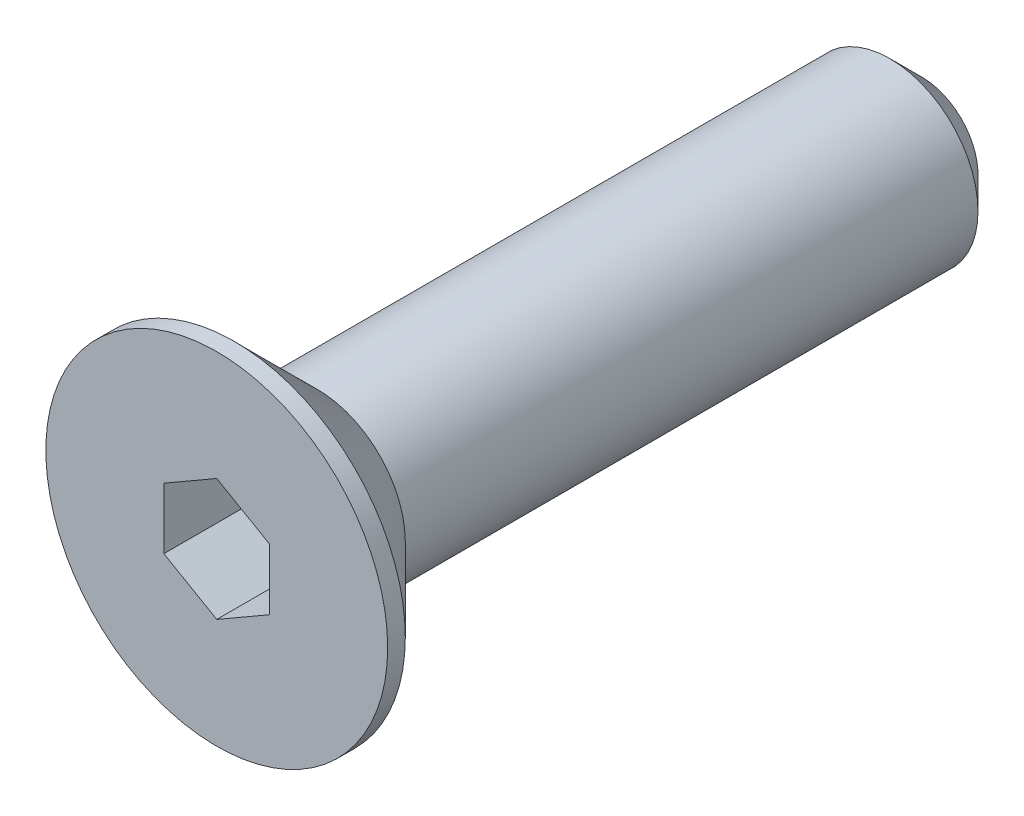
ISO-10303-21;
HEADER;
FILE_DESCRIPTION(('STEP AP214'),'2;1');
FILE_NAME('part.step','',(''),(''),'','','');
FILE_SCHEMA(('AUTOMOTIVE_DESIGN { 1 0 10303 214 1 1 1 1 }'));
ENDSEC;
DATA;
#1=APPLICATION_CONTEXT('core data for automotive mechanical design processes');
#2=APPLICATION_PROTOCOL_DEFINITION('international standard','automotive_design',2000,#1);
#3=PRODUCT_CONTEXT('',#1,'mechanical');
#4=PRODUCT('Part','Part','',(#3));
#5=PRODUCT_RELATED_PRODUCT_CATEGORY('part','',(#4));
#6=PRODUCT_DEFINITION_FORMATION('','',#4);
#7=PRODUCT_DEFINITION_CONTEXT('part definition',#1,'design');
#8=PRODUCT_DEFINITION('design','',#6,#7);
#9=PRODUCT_DEFINITION_SHAPE('','',#8);
#10=(LENGTH_UNIT() NAMED_UNIT(*) SI_UNIT(.MILLI.,.METRE.));
#11=(NAMED_UNIT(*) PLANE_ANGLE_UNIT() SI_UNIT($,.RADIAN.));
#12=(NAMED_UNIT(*) SI_UNIT($,.STERADIAN.) SOLID_ANGLE_UNIT());
#13=UNCERTAINTY_MEASURE_WITH_UNIT(LENGTH_MEASURE(1.E-05),#10,'distance_accuracy_value','');
#14=(GEOMETRIC_REPRESENTATION_CONTEXT(3) GLOBAL_UNCERTAINTY_ASSIGNED_CONTEXT((#13)) GLOBAL_UNIT_ASSIGNED_CONTEXT((#10,
#11,#12)) REPRESENTATION_CONTEXT('',''));
#15=CARTESIAN_POINT('',(0.,0.,0.));
#16=DIRECTION('',(0.,0.,1.));
#17=DIRECTION('',(1.,0.,0.));
#18=AXIS2_PLACEMENT_3D('',#15,#16,#17);
#19=CARTESIAN_POINT('',(0.,0.,0.));
#20=DIRECTION('',(0.,0.,1.));
#21=DIRECTION('',(1.,0.,0.));
#22=AXIS2_PLACEMENT_3D('',#19,#20,#21);
#23=PLANE('',#22);
#24=DIRECTION('',(0.866025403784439,-0.5,0.));
#25=VECTOR('',#24,1.);
#26=CARTESIAN_POINT('',(-1.5,-0.866025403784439,0.));
#27=LINE('',#26,#25);
#28=CARTESIAN_POINT('',(-1.5,-0.866025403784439,0.));
#29=VERTEX_POINT('',#28);
#30=CARTESIAN_POINT('',(0.,-1.73205080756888,0.));
#31=VERTEX_POINT('',#30);
#32=EDGE_CURVE('E29',#29,#31,#27,.T.);
#33=ORIENTED_EDGE('',*,*,#32,.F.);
#34=DIRECTION('',(0.,-1.,0.));
#35=VECTOR('',#34,1.);
#36=CARTESIAN_POINT('',(-1.5,0.866025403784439,0.));
#37=LINE('',#36,#35);
#38=CARTESIAN_POINT('',(-1.5,0.866025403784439,0.));
#39=VERTEX_POINT('',#38);
#40=EDGE_CURVE('E98',#39,#29,#37,.T.);
#41=ORIENTED_EDGE('',*,*,#40,.F.);
#42=DIRECTION('',(-0.866025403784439,-0.5,0.));
#43=VECTOR('',#42,1.);
#44=CARTESIAN_POINT('',(0.,1.73205080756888,0.));
#45=LINE('',#44,#43);
#46=CARTESIAN_POINT('',(0.,1.73205080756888,0.));
#47=VERTEX_POINT('',#46);
#48=EDGE_CURVE('E92',#47,#39,#45,.T.);
#49=ORIENTED_EDGE('',*,*,#48,.F.);
#50=DIRECTION('',(-0.866025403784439,0.5,0.));
#51=VECTOR('',#50,1.);
#52=CARTESIAN_POINT('',(1.5,0.866025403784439,0.));
#53=LINE('',#52,#51);
#54=CARTESIAN_POINT('',(1.5,0.866025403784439,0.));
#55=VERTEX_POINT('',#54);
#56=EDGE_CURVE('E90',#55,#47,#53,.T.);
#57=ORIENTED_EDGE('',*,*,#56,.F.);
#58=DIRECTION('',(0.,1.,0.));
#59=VECTOR('',#58,1.);
#60=CARTESIAN_POINT('',(1.5,-0.866025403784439,0.));
#61=LINE('',#60,#59);
#62=CARTESIAN_POINT('',(1.5,-0.866025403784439,0.));
#63=VERTEX_POINT('',#62);
#64=EDGE_CURVE('E72',#63,#55,#61,.T.);
#65=ORIENTED_EDGE('',*,*,#64,.F.);
#66=DIRECTION('',(0.866025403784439,0.5,0.));
#67=VECTOR('',#66,1.);
#68=CARTESIAN_POINT('',(0.,-1.73205080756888,0.));
#69=LINE('',#68,#67);
#70=EDGE_CURVE('E83',#31,#63,#69,.T.);
#71=ORIENTED_EDGE('',*,*,#70,.F.);
#72=EDGE_LOOP('',(#33,#41,#49,#57,#65,#71));
#73=FACE_BOUND('',#72,.T.);
#74=CARTESIAN_POINT('',(0.,0.,0.));
#75=DIRECTION('',(0.,0.,1.));
#76=DIRECTION('',(1.,0.,0.));
#77=AXIS2_PLACEMENT_3D('',#74,#75,#76);
#78=CIRCLE('',#77,4.85);
#79=CARTESIAN_POINT('',(4.85,0.,0.));
#80=VERTEX_POINT('',#79);
#81=EDGE_CURVE('E128',#80,#80,#78,.T.);
#82=ORIENTED_EDGE('',*,*,#81,.T.);
#83=EDGE_LOOP('',(#82));
#84=FACE_BOUND('',#83,.T.);
#85=ADVANCED_FACE('F14',(#73,#84),#23,.T.);
#86=CARTESIAN_POINT('',(0.,0.,6.05968084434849));
#87=DIRECTION('',(0.,0.,1.));
#88=DIRECTION('',(1.,0.,0.));
#89=AXIS2_PLACEMENT_3D('',#86,#87,#88);
#90=CYLINDRICAL_SURFACE('',#89,4.85);
#91=CARTESIAN_POINT('',(0.,0.,-0.5));
#92=DIRECTION('',(0.,0.,1.));
#93=DIRECTION('',(1.,0.,0.));
#94=AXIS2_PLACEMENT_3D('',#91,#92,#93);
#95=CIRCLE('',#94,4.85);
#96=CARTESIAN_POINT('',(4.85,0.,-0.5));
#97=VERTEX_POINT('',#96);
#98=EDGE_CURVE('E125',#97,#97,#95,.T.);
#99=ORIENTED_EDGE('',*,*,#98,.T.);
#100=EDGE_LOOP('',(#99));
#101=FACE_BOUND('',#100,.T.);
#102=ORIENTED_EDGE('',*,*,#81,.F.);
#103=EDGE_LOOP('',(#102));
#104=FACE_BOUND('',#103,.T.);
#105=ADVANCED_FACE('F148',(#101,#104),#90,.T.);
#106=CARTESIAN_POINT('',(0.,0.,-0.5));
#107=DIRECTION('',(0.,0.,1.));
#108=DIRECTION('',(1.,0.,0.));
#109=AXIS2_PLACEMENT_3D('',#106,#107,#108);
#110=CONICAL_SURFACE('',#109,4.85,0.78539816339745);
#111=CARTESIAN_POINT('',(0.,0.,-2.85));
#112=DIRECTION('',(0.,0.,1.));
#113=DIRECTION('',(1.,0.,0.));
#114=AXIS2_PLACEMENT_3D('',#111,#112,#113);
#115=CIRCLE('',#114,2.5);
#116=CARTESIAN_POINT('',(2.5,0.,-2.85));
#117=VERTEX_POINT('',#116);
#118=EDGE_CURVE('E116',#117,#117,#115,.T.);
#119=ORIENTED_EDGE('',*,*,#118,.T.);
#120=EDGE_LOOP('',(#119));
#121=FACE_BOUND('',#120,.T.);
#122=ORIENTED_EDGE('',*,*,#98,.F.);
#123=EDGE_LOOP('',(#122));
#124=FACE_BOUND('',#123,.T.);
#125=ADVANCED_FACE('F153',(#121,#124),#110,.T.);
#126=CARTESIAN_POINT('',(0.,0.,6.05968084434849));
#127=DIRECTION('',(0.,0.,1.));
#128=DIRECTION('',(1.,0.,0.));
#129=AXIS2_PLACEMENT_3D('',#126,#127,#128);
#130=CYLINDRICAL_SURFACE('',#129,2.5);
#131=CARTESIAN_POINT('',(0.,0.,-19.1));
#132=DIRECTION('',(0.,0.,-1.));
#133=DIRECTION('',(-1.,0.,0.));
#134=AXIS2_PLACEMENT_3D('',#131,#132,#133);
#135=CIRCLE('',#134,2.5);
#136=CARTESIAN_POINT('',(-2.5,0.,-19.1));
#137=VERTEX_POINT('',#136);
#138=EDGE_CURVE('E22',#137,#137,#135,.F.);
#139=ORIENTED_EDGE('',*,*,#138,.T.);
#140=EDGE_LOOP('',(#139));
#141=FACE_BOUND('',#140,.T.);
#142=ORIENTED_EDGE('',*,*,#118,.F.);
#143=EDGE_LOOP('',(#142));
#144=FACE_BOUND('',#143,.T.);
#145=ADVANCED_FACE('F133',(#141,#144),#130,.T.);
#146=CARTESIAN_POINT('',(2.5,0.,-20.));
#147=DIRECTION('',(0.,0.,-1.));
#148=DIRECTION('',(-1.,0.,0.));
#149=AXIS2_PLACEMENT_3D('',#146,#147,#148);
#150=PLANE('',#149);
#151=CARTESIAN_POINT('',(0.,0.,-20.));
#152=DIRECTION('',(0.,0.,-1.));
#153=DIRECTION('',(-1.,0.,0.));
#154=AXIS2_PLACEMENT_3D('',#151,#152,#153);
#155=CIRCLE('',#154,1.6);
#156=CARTESIAN_POINT('',(-1.6,0.,-20.));
#157=VERTEX_POINT('',#156);
#158=EDGE_CURVE('E9',#157,#157,#155,.T.);
#159=ORIENTED_EDGE('',*,*,#158,.T.);
#160=EDGE_LOOP('',(#159));
#161=FACE_BOUND('',#160,.T.);
#162=ADVANCED_FACE('F162',(#161),#150,.T.);
#163=CARTESIAN_POINT('',(-1.5,-0.866025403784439,-2.5));
#164=DIRECTION('',(-0.5,-0.866025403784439,0.));
#165=DIRECTION('',(0.866025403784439,-0.5,0.));
#166=AXIS2_PLACEMENT_3D('',#163,#164,#165);
#167=PLANE('',#166);
#168=ORIENTED_EDGE('',*,*,#32,.T.);
#169=DIRECTION('',(0.,0.,1.));
#170=VECTOR('',#169,1.);
#171=CARTESIAN_POINT('',(0.,-1.73205080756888,-2.5));
#172=LINE('',#171,#170);
#173=CARTESIAN_POINT('',(0.,-1.73205080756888,-2.5));
#174=VERTEX_POINT('',#173);
#175=EDGE_CURVE('E80',#174,#31,#172,.T.);
#176=ORIENTED_EDGE('',*,*,#175,.F.);
#177=DIRECTION('',(0.866025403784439,-0.5,0.));
#178=VECTOR('',#177,1.);
#179=CARTESIAN_POINT('',(-1.5,-0.866025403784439,-2.5));
#180=LINE('',#179,#178);
#181=CARTESIAN_POINT('',(-1.5,-0.866025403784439,-2.5));
#182=VERTEX_POINT('',#181);
#183=EDGE_CURVE('E100',#182,#174,#180,.T.);
#184=ORIENTED_EDGE('',*,*,#183,.F.);
#185=DIRECTION('',(0.,0.,1.));
#186=VECTOR('',#185,1.);
#187=CARTESIAN_POINT('',(-1.5,-0.866025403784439,-2.5));
#188=LINE('',#187,#186);
#189=EDGE_CURVE('E36',#182,#29,#188,.T.);
#190=ORIENTED_EDGE('',*,*,#189,.T.);
#191=EDGE_LOOP('',(#168,#176,#184,#190));
#192=FACE_BOUND('',#191,.T.);
#193=ADVANCED_FACE('F165',(#192),#167,.F.);
#194=CARTESIAN_POINT('',(-1.5,0.866025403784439,-2.5));
#195=DIRECTION('',(-1.,0.,0.));
#196=DIRECTION('',(0.,0.,1.));
#197=AXIS2_PLACEMENT_3D('',#194,#195,#196);
#198=PLANE('',#197);
#199=ORIENTED_EDGE('',*,*,#40,.T.);
#200=ORIENTED_EDGE('',*,*,#189,.F.);
#201=DIRECTION('',(0.,-1.,0.));
#202=VECTOR('',#201,1.);
#203=CARTESIAN_POINT('',(-1.5,0.866025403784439,-2.5));
#204=LINE('',#203,#202);
#205=CARTESIAN_POINT('',(-1.5,0.866025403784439,-2.5));
#206=VERTEX_POINT('',#205);
#207=EDGE_CURVE('E112',#206,#182,#204,.T.);
#208=ORIENTED_EDGE('',*,*,#207,.F.);
#209=DIRECTION('',(0.,0.,1.));
#210=VECTOR('',#209,1.);
#211=CARTESIAN_POINT('',(-1.5,0.866025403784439,-2.5));
#212=LINE('',#211,#210);
#213=EDGE_CURVE('E117',#206,#39,#212,.T.);
#214=ORIENTED_EDGE('',*,*,#213,.T.);
#215=EDGE_LOOP('',(#199,#200,#208,#214));
#216=FACE_BOUND('',#215,.T.);
#217=ADVANCED_FACE('F169',(#216),#198,.F.);
#218=CARTESIAN_POINT('',(0.,1.73205080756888,-2.5));
#219=DIRECTION('',(-0.5,0.866025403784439,0.));
#220=DIRECTION('',(-0.866025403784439,-0.5,0.));
#221=AXIS2_PLACEMENT_3D('',#218,#219,#220);
#222=PLANE('',#221);
#223=ORIENTED_EDGE('',*,*,#48,.T.);
#224=ORIENTED_EDGE('',*,*,#213,.F.);
#225=DIRECTION('',(-0.866025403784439,-0.5,0.));
#226=VECTOR('',#225,1.);
#227=CARTESIAN_POINT('',(0.,1.73205080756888,-2.5));
#228=LINE('',#227,#226);
#229=CARTESIAN_POINT('',(0.,1.73205080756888,-2.5));
#230=VERTEX_POINT('',#229);
#231=EDGE_CURVE('E109',#230,#206,#228,.T.);
#232=ORIENTED_EDGE('',*,*,#231,.F.);
#233=DIRECTION('',(0.,0.,1.));
#234=VECTOR('',#233,1.);
#235=CARTESIAN_POINT('',(0.,1.73205080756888,-2.5));
#236=LINE('',#235,#234);
#237=EDGE_CURVE('E119',#230,#47,#236,.T.);
#238=ORIENTED_EDGE('',*,*,#237,.T.);
#239=EDGE_LOOP('',(#223,#224,#232,#238));
#240=FACE_BOUND('',#239,.T.);
#241=ADVANCED_FACE('F177',(#240),#222,.F.);
#242=CARTESIAN_POINT('',(1.5,0.866025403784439,-2.5));
#243=DIRECTION('',(0.5,0.866025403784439,0.));
#244=DIRECTION('',(-0.866025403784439,0.5,0.));
#245=AXIS2_PLACEMENT_3D('',#242,#243,#244);
#246=PLANE('',#245);
#247=ORIENTED_EDGE('',*,*,#56,.T.);
#248=ORIENTED_EDGE('',*,*,#237,.F.);
#249=DIRECTION('',(-0.866025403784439,0.5,0.));
#250=VECTOR('',#249,1.);
#251=CARTESIAN_POINT('',(1.5,0.866025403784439,-2.5));
#252=LINE('',#251,#250);
#253=CARTESIAN_POINT('',(1.5,0.866025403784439,-2.5));
#254=VERTEX_POINT('',#253);
#255=EDGE_CURVE('E106',#254,#230,#252,.T.);
#256=ORIENTED_EDGE('',*,*,#255,.F.);
#257=DIRECTION('',(0.,0.,1.));
#258=VECTOR('',#257,1.);
#259=CARTESIAN_POINT('',(1.5,0.866025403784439,-2.5));
#260=LINE('',#259,#258);
#261=EDGE_CURVE('E79',#254,#55,#260,.T.);
#262=ORIENTED_EDGE('',*,*,#261,.T.);
#263=EDGE_LOOP('',(#247,#248,#256,#262));
#264=FACE_BOUND('',#263,.T.);
#265=ADVANCED_FACE('F174',(#264),#246,.F.);
#266=CARTESIAN_POINT('',(1.5,-0.866025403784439,-2.5));
#267=DIRECTION('',(1.,0.,0.));
#268=DIRECTION('',(0.,1.,0.));
#269=AXIS2_PLACEMENT_3D('',#266,#267,#268);
#270=PLANE('',#269);
#271=ORIENTED_EDGE('',*,*,#64,.T.);
#272=ORIENTED_EDGE('',*,*,#261,.F.);
#273=DIRECTION('',(0.,1.,0.));
#274=VECTOR('',#273,1.);
#275=CARTESIAN_POINT('',(1.5,-0.866025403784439,-2.5));
#276=LINE('',#275,#274);
#277=CARTESIAN_POINT('',(1.5,-0.866025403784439,-2.5));
#278=VERTEX_POINT('',#277);
#279=EDGE_CURVE('E75',#278,#254,#276,.T.);
#280=ORIENTED_EDGE('',*,*,#279,.F.);
#281=DIRECTION('',(0.,0.,1.));
#282=VECTOR('',#281,1.);
#283=CARTESIAN_POINT('',(1.5,-0.866025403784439,-2.5));
#284=LINE('',#283,#282);
#285=EDGE_CURVE('E68',#278,#63,#284,.T.);
#286=ORIENTED_EDGE('',*,*,#285,.T.);
#287=EDGE_LOOP('',(#271,#272,#280,#286));
#288=FACE_BOUND('',#287,.T.);
#289=ADVANCED_FACE('F70',(#288),#270,.F.);
#290=CARTESIAN_POINT('',(0.,-1.73205080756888,-2.5));
#291=DIRECTION('',(0.5,-0.866025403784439,0.));
#292=DIRECTION('',(0.866025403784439,0.5,0.));
#293=AXIS2_PLACEMENT_3D('',#290,#291,#292);
#294=PLANE('',#293);
#295=ORIENTED_EDGE('',*,*,#70,.T.);
#296=ORIENTED_EDGE('',*,*,#285,.F.);
#297=DIRECTION('',(0.866025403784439,0.5,0.));
#298=VECTOR('',#297,1.);
#299=CARTESIAN_POINT('',(0.,-1.73205080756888,-2.5));
#300=LINE('',#299,#298);
#301=EDGE_CURVE('E103',#174,#278,#300,.T.);
#302=ORIENTED_EDGE('',*,*,#301,.F.);
#303=ORIENTED_EDGE('',*,*,#175,.T.);
#304=EDGE_LOOP('',(#295,#296,#302,#303));
#305=FACE_BOUND('',#304,.T.);
#306=ADVANCED_FACE('F84',(#305),#294,.F.);
#307=CARTESIAN_POINT('',(1.5,-2.59807621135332,-2.5));
#308=DIRECTION('',(0.,0.,1.));
#309=DIRECTION('',(1.,0.,0.));
#310=AXIS2_PLACEMENT_3D('',#307,#308,#309);
#311=PLANE('',#310);
#312=ORIENTED_EDGE('',*,*,#183,.T.);
#313=ORIENTED_EDGE('',*,*,#301,.T.);
#314=ORIENTED_EDGE('',*,*,#279,.T.);
#315=ORIENTED_EDGE('',*,*,#255,.T.);
#316=ORIENTED_EDGE('',*,*,#231,.T.);
#317=ORIENTED_EDGE('',*,*,#207,.T.);
#318=EDGE_LOOP('',(#312,#313,#314,#315,#316,#317));
#319=FACE_BOUND('',#318,.T.);
#320=ADVANCED_FACE('F137',(#319),#311,.T.);
#321=CARTESIAN_POINT('',(0.,0.,-19.1));
#322=DIRECTION('',(0.,0.,1.));
#323=DIRECTION('',(1.,0.,0.));
#324=AXIS2_PLACEMENT_3D('',#321,#322,#323);
#325=CONICAL_SURFACE('',#324,2.5,0.785398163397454);
#326=ORIENTED_EDGE('',*,*,#158,.F.);
#327=EDGE_LOOP('',(#326));
#328=FACE_BOUND('',#327,.T.);
#329=ORIENTED_EDGE('',*,*,#138,.F.);
#330=EDGE_LOOP('',(#329));
#331=FACE_BOUND('',#330,.T.);
#332=ADVANCED_FACE('F16',(#328,#331),#325,.T.);
#333=CLOSED_SHELL('',(#85,#105,#125,#145,#162,#193,#217,#241,#265,#289,#306,#320,#332));
#334=MANIFOLD_SOLID_BREP('B1',#333);
#335=ADVANCED_BREP_SHAPE_REPRESENTATION('',(#18,#334),#14);
#336=SHAPE_DEFINITION_REPRESENTATION(#9,#335);
ENDSEC;
END-ISO-10303-21;
